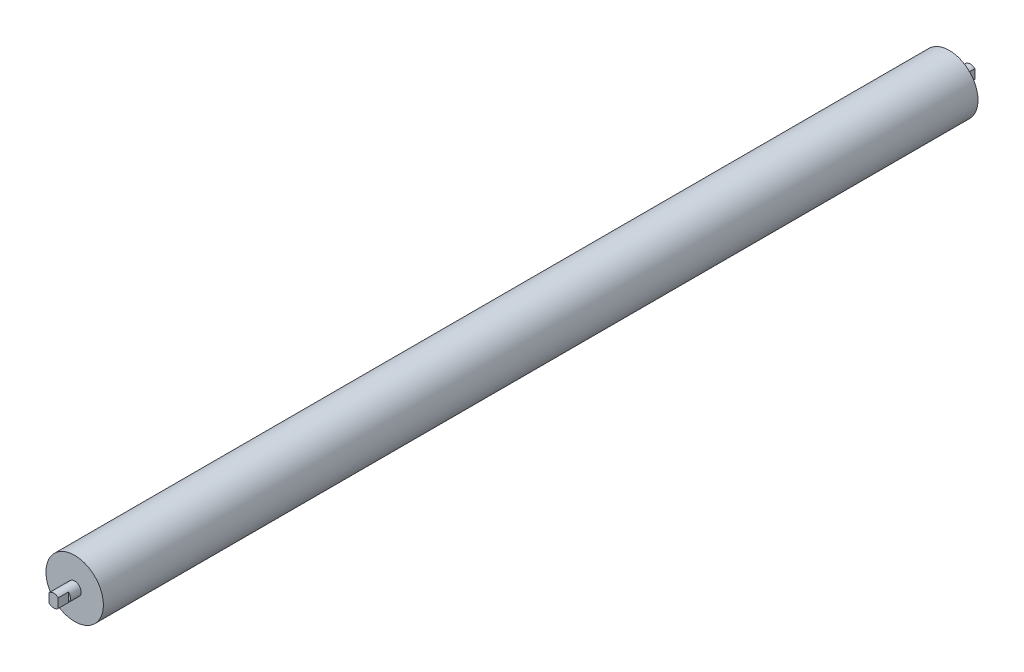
from build123d import *
from build123d.topology import SkipClean

# Parameters (mm, degrees)
ESQUISSE1_R             = 10
BASE_EXTRUSION_DEPTH    = 32.5
ESQUISSE2_R             = 44.5
BOSS_EXTRU_1_DEPTH      = 1355
ESQUISSE3_R             = 10
BOSS_EXTRU_2_DEPTH      = 32.5
ESQUISSE4_OUTSIDE_W     = 376.114
ESQUISSE4_OUTSIDE_H     = 376.114
ENL_V_MAT_EXTRU_1_DEPTH = 16
ESQUISSE5_OUTSIDE_W     = 376.114
ESQUISSE5_OUTSIDE_H     = 376.114
ENL_V_MAT_EXTRU_2_DEPTH = 16


with BuildPart() as part:
    # Esquisse1 → Base-Extrusion (new body)
    with BuildSketch(Plane.XY):
        Circle(ESQUISSE1_R)
    extrude(amount=BASE_EXTRUSION_DEPTH)

    # Esquisse2 → Boss.-Extru.1 (add)
    with BuildSketch(Plane.XY.offset(32.5)):
        Circle(ESQUISSE2_R)
    extrude(amount=BOSS_EXTRU_1_DEPTH)

    # Esquisse3 → Boss.-Extru.2 (add)
    with BuildSketch(Plane.XY.offset(1387.5)):
        Circle(ESQUISSE3_R)
    extrude(amount=BOSS_EXTRU_2_DEPTH)

    # Esquisse4 outside → Enl_v. mat.-Extru.1 (cut)
    with BuildSketch(Plane.XY.offset(1420)):
        Rectangle(ESQUISSE4_OUTSIDE_W, ESQUISSE4_OUTSIDE_H)
        with BuildLine():
            Line((-7, 7.141428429), (-7, -7.141428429))
            ThreePointArc((-7, -7.141428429), (0, -10), (7, -7.141428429))
            Line((7, -7.141428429), (7, 7.141428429))
            ThreePointArc((7, 7.141428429), (0, 10), (-7, 7.141428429))
        make_face(mode=Mode.SUBTRACT)
    extrude(amount=-ENL_V_MAT_EXTRU_1_DEPTH, mode=Mode.SUBTRACT)

    # Esquisse5 outside → Enl_v. mat.-Extru.2 (cut)
    with SkipClean():  # the faces are left unmerged after this step: merging them gives an invalid solid
        with BuildSketch(Plane(origin=(0, 0, 0), x_dir=(-1, 0, 0), z_dir=(0, 0, -1))):
            Rectangle(ESQUISSE5_OUTSIDE_W, ESQUISSE5_OUTSIDE_H)
            with BuildLine():
                Line((-7, 7.141428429), (-7, -7.141428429))
                ThreePointArc((-7, -7.141428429), (0, -10), (7, -7.141428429))
                Line((7, -7.141428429), (7, 7.141428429))
                ThreePointArc((7, 7.141428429), (0, 10), (-7, 7.141428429))
            make_face(mode=Mode.SUBTRACT)
        extrude(amount=-ENL_V_MAT_EXTRU_2_DEPTH, mode=Mode.SUBTRACT)


solid = part.part
